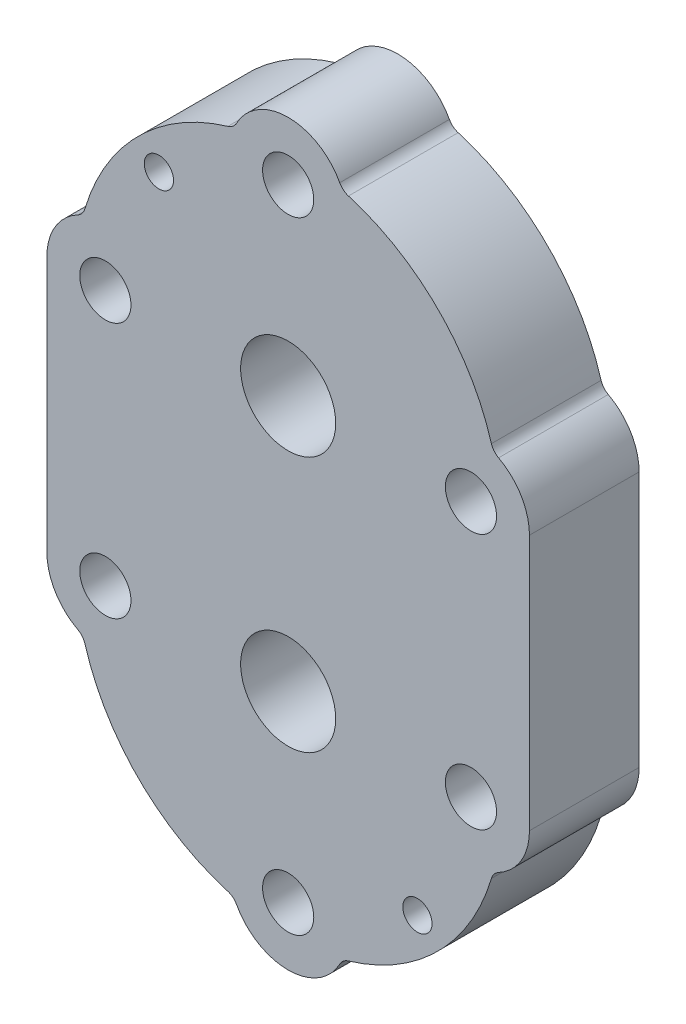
from build123d import *

# Parameters (mm, degrees)
EXTRUDE_1_DEPTH     = 15
EXTRUDE_2_DEPTH     = 15
FILLET_1_R          = 2
EXTRUDE_3_DEPTH     = 7
FILLET_2_R          = 2
SKETCH_4_R          = 3.5
SKETCH_4_R_2        = 2
CUT_EXTRUDE_1_DEPTH = 15
SKETCH_5_R          = 5.5
CUT_EXTRUDE_2_DEPTH = 4
SKETCH_6_R          = 6.5
CUT_EXTRUDE_3_DEPTH = 15


with BuildPart() as part:
    # Sketch 1 → Extrude 1 (new body)
    with BuildSketch(Plane.XY):
        with BuildLine():
            Line((29, 0), (29, -35))
            ThreePointArc((29, -35), (0, -64), (-29, -35))
            Line((-29, -35), (-29, 0))
            ThreePointArc((-29, 0), (0, 29), (29, 0))
        make_face()
    extrude(amount=EXTRUDE_1_DEPTH)

    # Sketch 2 → Extrude 2 (add)
    with BuildSketch(Plane(origin=(0, 0, 0), x_dir=(-1, 0, 0), z_dir=(0, 0, -1))):
        with BuildLine():
            Line((-29, 0), (-29, -35))
            ThreePointArc((-29, -35), (-28.758998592, -38.730951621), (-28.04, -42.399891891))
            ThreePointArc((-28.04, -42.399891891), (-31.64529909, -39.45421149), (-33, -35))
            Line((-33, -35), (-33, 0))
            ThreePointArc((-33, 0), (-31.64529909, 4.45421149), (-28.04, 7.399891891))
            ThreePointArc((-28.04, 7.399891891), (-28.758998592, 3.730951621), (-29, 0))
        make_face()
        with BuildLine():
            Line((29, -35), (29, 0))
            ThreePointArc((29, 0), (28.758998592, 3.730951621), (28.04, 7.399891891))
            ThreePointArc((28.04, 7.399891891), (31.64529909, 4.45421149), (33, 0))
            Line((33, 0), (33, -35))
            ThreePointArc((33, -35), (31.64529909, -39.45421149), (28.04, -42.399891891))
            ThreePointArc((28.04, -42.399891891), (28.758998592, -38.730951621), (29, -35))
        make_face()
        with BuildLine():
            ThreePointArc((-7.399891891, -63.04), (0, -68), (7.399891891, -63.04))
            ThreePointArc((7.399891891, -63.04), (0, -64), (-7.399891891, -63.04))
        make_face()
        with BuildLine():
            ThreePointArc((7.399891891, 28.04), (0, 33), (-7.399891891, 28.04))
            ThreePointArc((-7.399891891, 28.04), (0, 29), (7.399891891, 28.04))
        make_face()
    extrude(amount=-EXTRUDE_2_DEPTH)

    # Fillet 1
    fillet_1_edges = [part.edges().sort_by_distance(p)[0] for p in [
        (28.04, -42.399891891, 7.5),
        (28.04, 7.399891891, 7.5),
        (-28.04, 7.399891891, 7.5),
        (-28.04, -42.399891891, 7.5),
        (7.399891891, 28.04, 7.5),
        (-7.399891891, 28.04, 7.5),
        (-7.399891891, -63.04, 7.5),
        (7.399891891, -63.04, 7.5),
    ]]
    fillet(fillet_1_edges, radius=FILLET_1_R)

    # Sketch 3 → Extrude 3 (add)
    with BuildSketch(Plane(origin=(0, 0, 0), x_dir=(-1, 0, 0), z_dir=(0, 0, -1))):
        with BuildLine():
            Line((14, 0), (14, -35))
            ThreePointArc((14, -35), (0, -49), (-14, -35))
            Line((-14, -35), (-14, 0))
            ThreePointArc((-14, 0), (0, 14), (14, 0))
        make_face()
    extrude(amount=EXTRUDE_3_DEPTH)

    # Fillet 2
    fillet_2_edges = [part.edges().sort_by_distance(p)[0] for p in [
        (0, 14, 0),
        (14, -17.5, 0),
        (0, -49, 0),
        (-14, -17.5, 0),
        (0, 14, -7),
        (14, -17.5, -7),
        (0, -49, -7),
        (-14, -17.5, -7),
    ]]
    fillet(fillet_2_edges, radius=FILLET_2_R)

    # Sketch 4 → Cut-Extrude 1 (cut)
    with BuildSketch(Plane.XY.offset(15)):
        with Locations((0, -60)):
            Circle(SKETCH_4_R)
        with Locations((25, -35)):
            Circle(SKETCH_4_R)
        with Locations((25, 0)):
            Circle(SKETCH_4_R)
        with Locations((-25, 0)):
            Circle(SKETCH_4_R)
        with Locations((0, 25)):
            Circle(SKETCH_4_R)
        with Locations((-25, -35)):
            Circle(SKETCH_4_R)
        with Locations((-17.67766953, 17.67766953)):
            Circle(SKETCH_4_R_2)
        with Locations((17.67766953, -52.67766953)):
            Circle(SKETCH_4_R_2)
    extrude(amount=-CUT_EXTRUDE_1_DEPTH, mode=Mode.SUBTRACT)

    # Sketch 5 → Cut-Extrude 2 (cut)
    with BuildSketch(Plane(origin=(0, 0, 0), x_dir=(-1, 0, 0), z_dir=(0, 0, -1))):
        with Locations((0, -60)):
            Circle(SKETCH_5_R)
        with Locations((-25, -35)):
            Circle(SKETCH_5_R)
        with Locations((-25, 0)):
            Circle(SKETCH_5_R)
        with Locations((25, -35)):
            Circle(SKETCH_5_R)
        with Locations((25, 0)):
            Circle(SKETCH_5_R)
        with Locations((0, 25)):
            Circle(SKETCH_5_R)
    extrude(amount=-CUT_EXTRUDE_2_DEPTH, mode=Mode.SUBTRACT)

    # Sketch 6 → Cut-Extrude 3 (cut)
    with BuildSketch(Plane.XY.offset(15)):
        with Locations((0, -35)):
            Circle(SKETCH_6_R)
        Circle(SKETCH_6_R)
    extrude(amount=-CUT_EXTRUDE_3_DEPTH, mode=Mode.SUBTRACT)

    # Sketch 8 → Cut-Revolve 4 (revolve, cut)
    with BuildSketch(Plane(origin=(0, 0, 0), x_dir=(0, 0, -1), z_dir=(1, 0, 0)), mode=Mode.PRIVATE) as cut_revolve_4_sk:
        Polygon((0, -41.5), (3.75277675, -35), (0, -35), align=None)
    revolve(cut_revolve_4_sk.sketch.rotate(Axis((0, -35, -3.75277675), (0, 0, 1)), 90), axis=Axis((0, -35, -3.75277675), (0, 0, 1)), mode=Mode.SUBTRACT)

    # Sketch 9 → Cut-Revolve 5 (revolve, cut)
    with BuildSketch(Plane(origin=(0, 0, 0), x_dir=(0, 0, -1), z_dir=(1, 0, 0)), mode=Mode.PRIVATE) as cut_revolve_5_sk:
        Polygon((0, -6.5), (0, 0), (3.75277675, 0), align=None)
    revolve(cut_revolve_5_sk.sketch.rotate(Axis((0, 0, 0), (0, 0, -1)), 270), axis=Axis((0, 0, 0), (0, 0, -1)), mode=Mode.SUBTRACT)


solid = part.part
